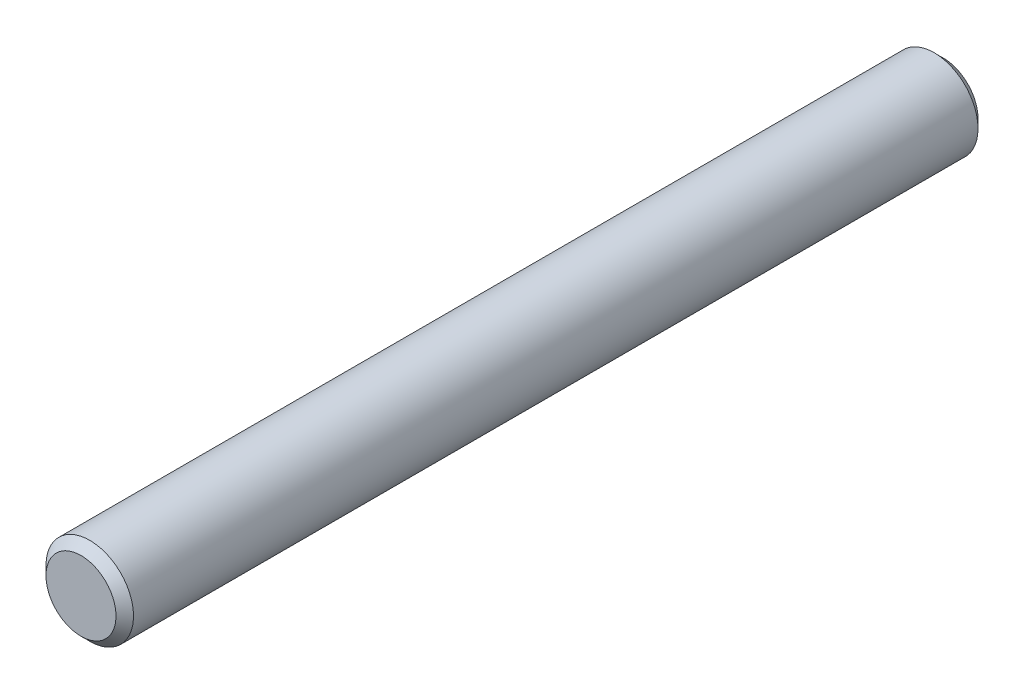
ISO-10303-21;
HEADER;
FILE_DESCRIPTION(('STEP AP214'),'2;1');
FILE_NAME('part.step','',(''),(''),'','','');
FILE_SCHEMA(('AUTOMOTIVE_DESIGN { 1 0 10303 214 1 1 1 1 }'));
ENDSEC;
DATA;
#1=APPLICATION_CONTEXT('core data for automotive mechanical design processes');
#2=APPLICATION_PROTOCOL_DEFINITION('international standard','automotive_design',2000,#1);
#3=PRODUCT_CONTEXT('',#1,'mechanical');
#4=PRODUCT('Part','Part','',(#3));
#5=PRODUCT_RELATED_PRODUCT_CATEGORY('part','',(#4));
#6=PRODUCT_DEFINITION_FORMATION('','',#4);
#7=PRODUCT_DEFINITION_CONTEXT('part definition',#1,'design');
#8=PRODUCT_DEFINITION('design','',#6,#7);
#9=PRODUCT_DEFINITION_SHAPE('','',#8);
#10=(LENGTH_UNIT() NAMED_UNIT(*) SI_UNIT(.MILLI.,.METRE.));
#11=(NAMED_UNIT(*) PLANE_ANGLE_UNIT() SI_UNIT($,.RADIAN.));
#12=(NAMED_UNIT(*) SI_UNIT($,.STERADIAN.) SOLID_ANGLE_UNIT());
#13=UNCERTAINTY_MEASURE_WITH_UNIT(LENGTH_MEASURE(1.E-05),#10,'distance_accuracy_value','');
#14=(GEOMETRIC_REPRESENTATION_CONTEXT(3) GLOBAL_UNCERTAINTY_ASSIGNED_CONTEXT((#13)) GLOBAL_UNIT_ASSIGNED_CONTEXT((#10,
#11,#12)) REPRESENTATION_CONTEXT('',''));
#15=CARTESIAN_POINT('',(0.,0.,0.));
#16=DIRECTION('',(0.,0.,1.));
#17=DIRECTION('',(1.,0.,0.));
#18=AXIS2_PLACEMENT_3D('',#15,#16,#17);
#19=CARTESIAN_POINT('',(0.,0.,19.7));
#20=DIRECTION('',(0.,0.,1.));
#21=DIRECTION('',(1.,0.,0.));
#22=AXIS2_PLACEMENT_3D('',#19,#20,#21);
#23=PLANE('',#22);
#24=CARTESIAN_POINT('',(0.,0.,19.7000000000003));
#25=DIRECTION('',(0.,0.,-1.));
#26=DIRECTION('',(-1.,0.,0.));
#27=AXIS2_PLACEMENT_3D('',#24,#25,#26);
#28=CIRCLE('',#27,0.800000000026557);
#29=CARTESIAN_POINT('',(-0.800000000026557,0.,19.7000000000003));
#30=VERTEX_POINT('',#29);
#31=EDGE_CURVE('E17',#30,#30,#28,.T.);
#32=ORIENTED_EDGE('',*,*,#31,.F.);
#33=EDGE_LOOP('',(#32));
#34=FACE_BOUND('',#33,.T.);
#35=ADVANCED_FACE('F14',(#34),#23,.T.);
#36=CARTESIAN_POINT('',(0.,0.,0.));
#37=DIRECTION('',(0.,0.,1.));
#38=DIRECTION('',(1.,0.,0.));
#39=AXIS2_PLACEMENT_3D('',#36,#37,#38);
#40=PLANE('',#39);
#41=CARTESIAN_POINT('',(0.,0.,0.));
#42=DIRECTION('',(0.,0.,1.));
#43=DIRECTION('',(1.,0.,0.));
#44=AXIS2_PLACEMENT_3D('',#41,#42,#43);
#45=CIRCLE('',#44,0.799999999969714);
#46=CARTESIAN_POINT('',(0.799999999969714,0.,0.));
#47=VERTEX_POINT('',#46);
#48=EDGE_CURVE('E26',#47,#47,#45,.T.);
#49=ORIENTED_EDGE('',*,*,#48,.F.);
#50=EDGE_LOOP('',(#49));
#51=FACE_BOUND('',#50,.T.);
#52=ADVANCED_FACE('F37',(#51),#40,.F.);
#53=CARTESIAN_POINT('',(0.,0.,19.5000000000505));
#54=DIRECTION('',(0.,0.,-1.));
#55=DIRECTION('',(-1.,0.,0.));
#56=AXIS2_PLACEMENT_3D('',#53,#54,#55);
#57=CONICAL_SURFACE('',#56,0.999999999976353,0.785398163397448);
#58=CARTESIAN_POINT('',(0.,0.,19.5));
#59=DIRECTION('',(0.,0.,-1.));
#60=DIRECTION('',(-1.,0.,0.));
#61=AXIS2_PLACEMENT_3D('',#58,#59,#60);
#62=CIRCLE('',#61,1.);
#63=CARTESIAN_POINT('',(-1.,0.,19.5));
#64=VERTEX_POINT('',#63);
#65=EDGE_CURVE('E21',#64,#64,#62,.T.);
#66=ORIENTED_EDGE('',*,*,#65,.F.);
#67=EDGE_LOOP('',(#66));
#68=FACE_BOUND('',#67,.T.);
#69=ORIENTED_EDGE('',*,*,#31,.T.);
#70=EDGE_LOOP('',(#69));
#71=FACE_BOUND('',#70,.T.);
#72=ADVANCED_FACE('F34',(#68,#71),#57,.T.);
#73=CARTESIAN_POINT('',(0.,0.,0.199999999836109));
#74=DIRECTION('',(0.,0.,1.));
#75=DIRECTION('',(1.,0.,0.));
#76=AXIS2_PLACEMENT_3D('',#73,#74,#75);
#77=CONICAL_SURFACE('',#76,0.999999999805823,0.785398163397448);
#78=CARTESIAN_POINT('',(0.,0.,0.199999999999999));
#79=DIRECTION('',(0.,0.,-1.));
#80=DIRECTION('',(-1.,0.,0.));
#81=AXIS2_PLACEMENT_3D('',#78,#79,#80);
#82=CIRCLE('',#81,1.);
#83=CARTESIAN_POINT('',(-1.,0.,0.199999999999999));
#84=VERTEX_POINT('',#83);
#85=EDGE_CURVE('E10',#84,#84,#82,.F.);
#86=ORIENTED_EDGE('',*,*,#85,.F.);
#87=EDGE_LOOP('',(#86));
#88=FACE_BOUND('',#87,.T.);
#89=ORIENTED_EDGE('',*,*,#48,.T.);
#90=EDGE_LOOP('',(#89));
#91=FACE_BOUND('',#90,.T.);
#92=ADVANCED_FACE('F45',(#88,#91),#77,.T.);
#93=CARTESIAN_POINT('',(0.,0.,19.7));
#94=DIRECTION('',(0.,0.,-1.));
#95=DIRECTION('',(-1.,0.,0.));
#96=AXIS2_PLACEMENT_3D('',#93,#94,#95);
#97=CYLINDRICAL_SURFACE('',#96,1.);
#98=ORIENTED_EDGE('',*,*,#85,.T.);
#99=EDGE_LOOP('',(#98));
#100=FACE_BOUND('',#99,.T.);
#101=ORIENTED_EDGE('',*,*,#65,.T.);
#102=EDGE_LOOP('',(#101));
#103=FACE_BOUND('',#102,.T.);
#104=ADVANCED_FACE('F43',(#100,#103),#97,.T.);
#105=CLOSED_SHELL('',(#35,#52,#72,#92,#104));
#106=MANIFOLD_SOLID_BREP('B1',#105);
#107=ADVANCED_BREP_SHAPE_REPRESENTATION('',(#18,#106),#14);
#108=SHAPE_DEFINITION_REPRESENTATION(#9,#107);
ENDSEC;
END-ISO-10303-21;
